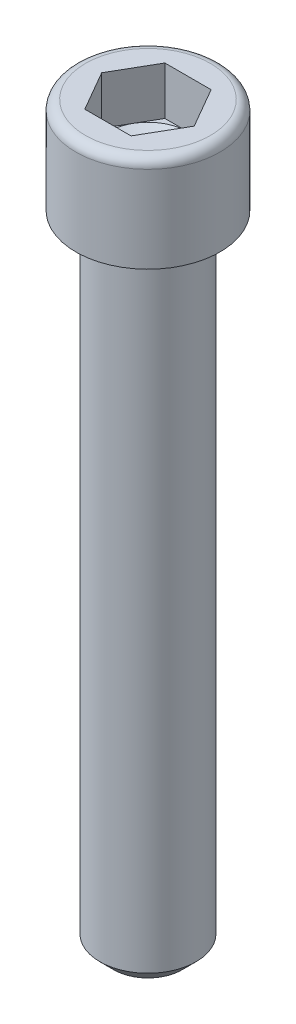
ISO-10303-21;
HEADER;
FILE_DESCRIPTION(('STEP AP214'),'2;1');
FILE_NAME('part.step','',(''),(''),'','','');
FILE_SCHEMA(('AUTOMOTIVE_DESIGN { 1 0 10303 214 1 1 1 1 }'));
ENDSEC;
DATA;
#1=APPLICATION_CONTEXT('core data for automotive mechanical design processes');
#2=APPLICATION_PROTOCOL_DEFINITION('international standard','automotive_design',2000,#1);
#3=PRODUCT_CONTEXT('',#1,'mechanical');
#4=PRODUCT('Part','Part','',(#3));
#5=PRODUCT_RELATED_PRODUCT_CATEGORY('part','',(#4));
#6=PRODUCT_DEFINITION_FORMATION('','',#4);
#7=PRODUCT_DEFINITION_CONTEXT('part definition',#1,'design');
#8=PRODUCT_DEFINITION('design','',#6,#7);
#9=PRODUCT_DEFINITION_SHAPE('','',#8);
#10=(LENGTH_UNIT() NAMED_UNIT(*) SI_UNIT(.MILLI.,.METRE.));
#11=(NAMED_UNIT(*) PLANE_ANGLE_UNIT() SI_UNIT($,.RADIAN.));
#12=(NAMED_UNIT(*) SI_UNIT($,.STERADIAN.) SOLID_ANGLE_UNIT());
#13=UNCERTAINTY_MEASURE_WITH_UNIT(LENGTH_MEASURE(1.E-05),#10,'distance_accuracy_value','');
#14=(GEOMETRIC_REPRESENTATION_CONTEXT(3) GLOBAL_UNCERTAINTY_ASSIGNED_CONTEXT((#13)) GLOBAL_UNIT_ASSIGNED_CONTEXT((#10,
#11,#12)) REPRESENTATION_CONTEXT('',''));
#15=CARTESIAN_POINT('',(0.,0.,0.));
#16=DIRECTION('',(0.,0.,1.));
#17=DIRECTION('',(1.,0.,0.));
#18=AXIS2_PLACEMENT_3D('',#15,#16,#17);
#19=CARTESIAN_POINT('',(4.99999999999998,11.9999999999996,1.52655665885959E-13));
#20=DIRECTION('',(0.,-1.,0.));
#21=DIRECTION('',(0.999999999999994,0.,0.));
#22=AXIS2_PLACEMENT_3D('',#19,#20,#21);
#23=PLANE('',#22);
#24=CARTESIAN_POINT('',(0.,12.,0.));
#25=DIRECTION('',(0.,1.,0.));
#26=DIRECTION('',(-0.999999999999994,0.,0.));
#27=AXIS2_PLACEMENT_3D('',#24,#25,#26);
#28=CIRCLE('',#27,7.8);
#29=CARTESIAN_POINT('',(-7.79999999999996,12.,0.));
#30=VERTEX_POINT('',#29);
#31=EDGE_CURVE('E140',#30,#30,#28,.T.);
#32=ORIENTED_EDGE('',*,*,#31,.T.);
#33=EDGE_LOOP('',(#32));
#34=FACE_BOUND('',#33,.T.);
#35=DIRECTION('',(0.499999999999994,0.,0.866025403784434));
#36=VECTOR('',#35,1.);
#37=CARTESIAN_POINT('',(2.88675134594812,11.9999999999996,-4.99999999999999));
#38=LINE('',#37,#36);
#39=CARTESIAN_POINT('',(2.88675134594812,11.9999999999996,-4.99999999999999));
#40=VERTEX_POINT('',#39);
#41=CARTESIAN_POINT('',(5.77350269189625,11.9999999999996,0.));
#42=VERTEX_POINT('',#41);
#43=EDGE_CURVE('E372',#40,#42,#38,.T.);
#44=ORIENTED_EDGE('',*,*,#43,.T.);
#45=DIRECTION('',(-0.499999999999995,0.,0.866025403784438));
#46=VECTOR('',#45,1.);
#47=CARTESIAN_POINT('',(2.88675134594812,12.,5.00000000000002));
#48=LINE('',#47,#46);
#49=CARTESIAN_POINT('',(2.88675134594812,12.,5.00000000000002));
#50=VERTEX_POINT('',#49);
#51=EDGE_CURVE('E375',#42,#50,#48,.T.);
#52=ORIENTED_EDGE('',*,*,#51,.T.);
#53=DIRECTION('',(-0.999999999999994,0.,0.));
#54=VECTOR('',#53,1.);
#55=CARTESIAN_POINT('',(2.88675134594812,12.,5.00000000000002));
#56=LINE('',#55,#54);
#57=CARTESIAN_POINT('',(-2.88675134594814,11.9999999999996,5.00000000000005));
#58=VERTEX_POINT('',#57);
#59=EDGE_CURVE('E378',#50,#58,#56,.T.);
#60=ORIENTED_EDGE('',*,*,#59,.T.);
#61=DIRECTION('',(-0.499999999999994,0.,-0.866025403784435));
#62=VECTOR('',#61,1.);
#63=CARTESIAN_POINT('',(-2.88675134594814,11.9999999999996,5.00000000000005));
#64=LINE('',#63,#62);
#65=CARTESIAN_POINT('',(-5.77350269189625,11.9999999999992,0.));
#66=VERTEX_POINT('',#65);
#67=EDGE_CURVE('E117',#58,#66,#64,.T.);
#68=ORIENTED_EDGE('',*,*,#67,.T.);
#69=DIRECTION('',(0.499999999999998,0.,-0.86602540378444));
#70=VECTOR('',#69,1.);
#71=CARTESIAN_POINT('',(-2.88675134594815,12.,-4.99999999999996));
#72=LINE('',#71,#70);
#73=CARTESIAN_POINT('',(-2.88675134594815,12.,-4.99999999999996));
#74=VERTEX_POINT('',#73);
#75=EDGE_CURVE('E369',#66,#74,#72,.T.);
#76=ORIENTED_EDGE('',*,*,#75,.T.);
#77=DIRECTION('',(0.999999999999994,0.,0.));
#78=VECTOR('',#77,1.);
#79=CARTESIAN_POINT('',(2.88675134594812,11.9999999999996,-4.99999999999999));
#80=LINE('',#79,#78);
#81=EDGE_CURVE('E128',#74,#40,#80,.T.);
#82=ORIENTED_EDGE('',*,*,#81,.T.);
#83=EDGE_LOOP('',(#44,#52,#60,#68,#76,#82));
#84=FACE_BOUND('',#83,.T.);
#85=ADVANCED_FACE('F34',(#34,#84),#23,.F.);
#86=CARTESIAN_POINT('',(0.,-80.,0.));
#87=DIRECTION('',(0.,1.,0.));
#88=DIRECTION('',(0.,0.,0.999999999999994));
#89=AXIS2_PLACEMENT_3D('',#86,#87,#88);
#90=CYLINDRICAL_SURFACE('',#89,6.);
#91=CARTESIAN_POINT('',(0.,-78.25,0.));
#92=DIRECTION('',(0.,1.,0.));
#93=DIRECTION('',(0.,0.,0.999999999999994));
#94=AXIS2_PLACEMENT_3D('',#91,#92,#93);
#95=CIRCLE('',#94,6.);
#96=CARTESIAN_POINT('',(0.,-78.25,5.99999999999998));
#97=VERTEX_POINT('',#96);
#98=EDGE_CURVE('E42',#97,#97,#95,.T.);
#99=ORIENTED_EDGE('',*,*,#98,.T.);
#100=EDGE_LOOP('',(#99));
#101=FACE_BOUND('',#100,.T.);
#102=CARTESIAN_POINT('',(0.,0.,0.));
#103=DIRECTION('',(0.,1.,0.));
#104=DIRECTION('',(0.,0.,0.999999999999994));
#105=AXIS2_PLACEMENT_3D('',#102,#103,#104);
#106=CIRCLE('',#105,6.);
#107=CARTESIAN_POINT('',(0.,0.,5.99999999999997));
#108=VERTEX_POINT('',#107);
#109=EDGE_CURVE('E150',#108,#108,#106,.T.);
#110=ORIENTED_EDGE('',*,*,#109,.F.);
#111=EDGE_LOOP('',(#110));
#112=FACE_BOUND('',#111,.T.);
#113=ADVANCED_FACE('F155',(#101,#112),#90,.T.);
#114=CARTESIAN_POINT('',(0.,-80.,0.));
#115=DIRECTION('',(0.,1.,0.));
#116=DIRECTION('',(0.,0.,0.999999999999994));
#117=AXIS2_PLACEMENT_3D('',#114,#115,#116);
#118=PLANE('',#117);
#119=CARTESIAN_POINT('',(0.,-80.,0.));
#120=DIRECTION('',(0.,1.,0.));
#121=DIRECTION('',(0.,0.,0.999999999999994));
#122=AXIS2_PLACEMENT_3D('',#119,#120,#121);
#123=CIRCLE('',#122,4.25);
#124=CARTESIAN_POINT('',(0.,-80.,4.24999999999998));
#125=VERTEX_POINT('',#124);
#126=EDGE_CURVE('E11',#125,#125,#123,.F.);
#127=ORIENTED_EDGE('',*,*,#126,.T.);
#128=EDGE_LOOP('',(#127));
#129=FACE_BOUND('',#128,.T.);
#130=ADVANCED_FACE('F160',(#129),#118,.F.);
#131=CARTESIAN_POINT('',(0.,-78.25,0.));
#132=DIRECTION('',(0.,1.,0.));
#133=DIRECTION('',(0.,0.,0.999999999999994));
#134=AXIS2_PLACEMENT_3D('',#131,#132,#133);
#135=CONICAL_SURFACE('',#134,6.,0.785398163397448);
#136=CARTESIAN_POINT('',(0.,-80.,4.24999999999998));
#137=CARTESIAN_POINT('',(0.,-79.9817708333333,4.26822916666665));
#138=CARTESIAN_POINT('',(0.,-79.9635416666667,4.28645833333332));
#139=CARTESIAN_POINT('',(0.,-79.9270833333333,4.32291666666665));
#140=CARTESIAN_POINT('',(0.,-79.9088541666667,4.34114583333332));
#141=CARTESIAN_POINT('',(0.,-79.8723958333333,4.37760416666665));
#142=CARTESIAN_POINT('',(0.,-79.8541666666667,4.39583333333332));
#143=CARTESIAN_POINT('',(0.,-79.8177083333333,4.43229166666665));
#144=CARTESIAN_POINT('',(0.,-79.7994791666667,4.45052083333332));
#145=CARTESIAN_POINT('',(0.,-79.7630208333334,4.48697916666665));
#146=CARTESIAN_POINT('',(0.,-79.7447916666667,4.50520833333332));
#147=CARTESIAN_POINT('',(0.,-79.7083333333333,4.54166666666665));
#148=CARTESIAN_POINT('',(0.,-79.6901041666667,4.55989583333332));
#149=CARTESIAN_POINT('',(0.,-79.6536458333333,4.59635416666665));
#150=CARTESIAN_POINT('',(0.,-79.6354166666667,4.61458333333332));
#151=CARTESIAN_POINT('',(0.,-79.5989583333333,4.65104166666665));
#152=CARTESIAN_POINT('',(0.,-79.5807291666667,4.66927083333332));
#153=CARTESIAN_POINT('',(0.,-79.5442708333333,4.70572916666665));
#154=CARTESIAN_POINT('',(0.,-79.5260416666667,4.72395833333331));
#155=CARTESIAN_POINT('',(0.,-79.4895833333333,4.76041666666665));
#156=CARTESIAN_POINT('',(0.,-79.4713541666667,4.77864583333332));
#157=CARTESIAN_POINT('',(0.,-79.4348958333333,4.81510416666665));
#158=CARTESIAN_POINT('',(0.,-79.4166666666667,4.83333333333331));
#159=CARTESIAN_POINT('',(0.,-79.3802083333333,4.86979166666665));
#160=CARTESIAN_POINT('',(0.,-79.3619791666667,4.88802083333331));
#161=CARTESIAN_POINT('',(0.,-79.3255208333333,4.92447916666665));
#162=CARTESIAN_POINT('',(0.,-79.3072916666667,4.94270833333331));
#163=CARTESIAN_POINT('',(0.,-79.2708333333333,4.97916666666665));
#164=CARTESIAN_POINT('',(0.,-79.2526041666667,4.99739583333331));
#165=CARTESIAN_POINT('',(0.,-79.2161458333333,5.03385416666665));
#166=CARTESIAN_POINT('',(0.,-79.1979166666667,5.05208333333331));
#167=CARTESIAN_POINT('',(0.,-79.1614583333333,5.08854166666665));
#168=CARTESIAN_POINT('',(0.,-79.1432291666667,5.10677083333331));
#169=CARTESIAN_POINT('',(0.,-79.1067708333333,5.14322916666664));
#170=CARTESIAN_POINT('',(0.,-79.0885416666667,5.16145833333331));
#171=CARTESIAN_POINT('',(0.,-79.0520833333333,5.19791666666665));
#172=CARTESIAN_POINT('',(0.,-79.0338541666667,5.21614583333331));
#173=CARTESIAN_POINT('',(0.,-78.9973958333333,5.25260416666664));
#174=CARTESIAN_POINT('',(0.,-78.9791666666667,5.27083333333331));
#175=CARTESIAN_POINT('',(0.,-78.9427083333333,5.30729166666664));
#176=CARTESIAN_POINT('',(0.,-78.9244791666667,5.32552083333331));
#177=CARTESIAN_POINT('',(0.,-78.8880208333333,5.36197916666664));
#178=CARTESIAN_POINT('',(0.,-78.8697916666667,5.38020833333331));
#179=CARTESIAN_POINT('',(0.,-78.8333333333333,5.41666666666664));
#180=CARTESIAN_POINT('',(0.,-78.8151041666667,5.43489583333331));
#181=CARTESIAN_POINT('',(0.,-78.7786458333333,5.47135416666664));
#182=CARTESIAN_POINT('',(0.,-78.7604166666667,5.48958333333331));
#183=CARTESIAN_POINT('',(0.,-78.7239583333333,5.52604166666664));
#184=CARTESIAN_POINT('',(0.,-78.7057291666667,5.54427083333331));
#185=CARTESIAN_POINT('',(0.,-78.6692708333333,5.58072916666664));
#186=CARTESIAN_POINT('',(0.,-78.6510416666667,5.59895833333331));
#187=CARTESIAN_POINT('',(0.,-78.6145833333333,5.63541666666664));
#188=CARTESIAN_POINT('',(0.,-78.5963541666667,5.65364583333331));
#189=CARTESIAN_POINT('',(0.,-78.5598958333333,5.69010416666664));
#190=CARTESIAN_POINT('',(0.,-78.5416666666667,5.70833333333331));
#191=CARTESIAN_POINT('',(0.,-78.5052083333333,5.74479166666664));
#192=CARTESIAN_POINT('',(0.,-78.4869791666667,5.76302083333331));
#193=CARTESIAN_POINT('',(0.,-78.4505208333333,5.79947916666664));
#194=CARTESIAN_POINT('',(0.,-78.4322916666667,5.81770833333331));
#195=CARTESIAN_POINT('',(0.,-78.3958333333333,5.85416666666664));
#196=CARTESIAN_POINT('',(0.,-78.3776041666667,5.87239583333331));
#197=CARTESIAN_POINT('',(0.,-78.3411458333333,5.90885416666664));
#198=CARTESIAN_POINT('',(0.,-78.3229166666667,5.92708333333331));
#199=CARTESIAN_POINT('',(0.,-78.2864583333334,5.96354166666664));
#200=CARTESIAN_POINT('',(0.,-78.2682291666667,5.98177083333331));
#201=CARTESIAN_POINT('',(0.,-78.25,5.99999999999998));
#202=B_SPLINE_CURVE_WITH_KNOTS('',3,(#136,#137,#138,#139,#140,#141,#142,#143,#144,#145,#146,
#147,#148,#149,#150,#151,#152,#153,#154,#155,#156,#157,#158,#159,#160,#161,#162,#163,#164,#165,
#166,#167,#168,#169,#170,#171,#172,#173,#174,#175,#176,#177,#178,#179,#180,#181,#182,#183,#184,
#185,#186,#187,#188,#189,#190,#191,#192,#193,#194,#195,#196,#197,#198,#199,#200,#201),
.UNSPECIFIED.,.F.,.F.,(4,2,2,2,2,2,2,2,2,2,2,2,2,2,2,2,2,2,2,2,2,2,2,2,2,2,2,2,2,2,2,2,4),(0.,
0.0773398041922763,0.154679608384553,0.23201941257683,0.309359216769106,0.386699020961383,
0.464038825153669,0.541378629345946,0.618718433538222,0.696058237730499,0.773398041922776,
0.850737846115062,0.928077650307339,1.00541745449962,1.08275725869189,1.16009706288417,
1.23743686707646,1.31477667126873,1.39211647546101,1.46945627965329,1.54679608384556,
1.62413588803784,1.70147569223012,1.7788154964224,1.85615530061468,1.93349510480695,
2.01083490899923,2.08817471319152,2.16551451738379,2.24285432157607,2.32019412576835,
2.39753392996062,2.4748737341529),.UNSPECIFIED.);
#203=EDGE_CURVE('BSEAM36',#125,#97,#202,.T.);
#204=ORIENTED_EDGE('',*,*,#126,.F.);
#205=ORIENTED_EDGE('',*,*,#98,.F.);
#206=ORIENTED_EDGE('',*,*,#203,.T.);
#207=ORIENTED_EDGE('',*,*,#203,.F.);
#208=EDGE_LOOP('',(#204,#206,#205,#207));
#209=FACE_BOUND('',#208,.T.);
#210=ADVANCED_FACE('F36',(#209),#135,.T.);
#211=CARTESIAN_POINT('',(0.,0.,0.));
#212=DIRECTION('',(0.,1.,0.));
#213=DIRECTION('',(-0.999999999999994,0.,0.));
#214=AXIS2_PLACEMENT_3D('',#211,#212,#213);
#215=PLANE('',#214);
#216=ORIENTED_EDGE('',*,*,#109,.T.);
#217=EDGE_LOOP('',(#216));
#218=FACE_BOUND('',#217,.T.);
#219=CARTESIAN_POINT('',(0.,0.,0.));
#220=DIRECTION('',(0.,1.,0.));
#221=DIRECTION('',(-0.999999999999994,0.,0.));
#222=AXIS2_PLACEMENT_3D('',#219,#220,#221);
#223=CIRCLE('',#222,9.);
#224=CARTESIAN_POINT('',(-8.99999999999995,0.,0.));
#225=VERTEX_POINT('',#224);
#226=EDGE_CURVE('E147',#225,#225,#223,.T.);
#227=ORIENTED_EDGE('',*,*,#226,.F.);
#228=EDGE_LOOP('',(#227));
#229=FACE_BOUND('',#228,.T.);
#230=ADVANCED_FACE('F159',(#218,#229),#215,.F.);
#231=CARTESIAN_POINT('',(0.,12.,0.));
#232=DIRECTION('',(0.,1.,0.));
#233=DIRECTION('',(-0.999999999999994,0.,0.));
#234=AXIS2_PLACEMENT_3D('',#231,#232,#233);
#235=CYLINDRICAL_SURFACE('',#234,9.);
#236=CARTESIAN_POINT('',(0.,10.8,0.));
#237=DIRECTION('',(0.,1.,0.));
#238=DIRECTION('',(-0.999999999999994,0.,0.));
#239=AXIS2_PLACEMENT_3D('',#236,#237,#238);
#240=CIRCLE('',#239,9.);
#241=CARTESIAN_POINT('',(-8.99999999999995,10.8,0.));
#242=VERTEX_POINT('',#241);
#243=EDGE_CURVE('E144',#242,#242,#240,.T.);
#244=ORIENTED_EDGE('',*,*,#243,.F.);
#245=EDGE_LOOP('',(#244));
#246=FACE_BOUND('',#245,.T.);
#247=ORIENTED_EDGE('',*,*,#226,.T.);
#248=EDGE_LOOP('',(#247));
#249=FACE_BOUND('',#248,.T.);
#250=ADVANCED_FACE('F166',(#246,#249),#235,.T.);
#251=CARTESIAN_POINT('',(0.,10.8,0.));
#252=DIRECTION('',(0.,1.,0.));
#253=DIRECTION('',(-0.999999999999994,0.,0.));
#254=AXIS2_PLACEMENT_3D('',#251,#252,#253);
#255=TOROIDAL_SURFACE('',#254,7.8,1.2);
#256=ORIENTED_EDGE('',*,*,#31,.F.);
#257=EDGE_LOOP('',(#256));
#258=FACE_BOUND('',#257,.T.);
#259=ORIENTED_EDGE('',*,*,#243,.T.);
#260=EDGE_LOOP('',(#259));
#261=FACE_BOUND('',#260,.T.);
#262=ADVANCED_FACE('F183',(#258,#261),#255,.T.);
#263=CARTESIAN_POINT('',(-2.88675134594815,6.00000000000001,-4.99999999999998));
#264=DIRECTION('',(0.866025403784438,0.,0.499999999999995));
#265=DIRECTION('',(0.499999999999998,0.,-0.86602540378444));
#266=AXIS2_PLACEMENT_3D('',#263,#264,#265);
#267=PLANE('',#266);
#268=ORIENTED_EDGE('',*,*,#75,.F.);
#269=DIRECTION('',(0.,1.,0.));
#270=VECTOR('',#269,1.);
#271=CARTESIAN_POINT('',(-5.77350269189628,5.99999999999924,0.));
#272=LINE('',#271,#270);
#273=CARTESIAN_POINT('',(-5.77350269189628,5.99999999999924,0.));
#274=VERTEX_POINT('',#273);
#275=EDGE_CURVE('E364',#274,#66,#272,.T.);
#276=ORIENTED_EDGE('',*,*,#275,.F.);
#277=DIRECTION('',(0.499999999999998,0.,-0.86602540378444));
#278=VECTOR('',#277,1.);
#279=CARTESIAN_POINT('',(-2.88675134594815,6.00000000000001,-4.99999999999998));
#280=LINE('',#279,#278);
#281=CARTESIAN_POINT('',(-4.33012701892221,5.99999999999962,-2.49999999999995));
#282=VERTEX_POINT('',#281);
#283=EDGE_CURVE('E113',#274,#282,#280,.T.);
#284=ORIENTED_EDGE('',*,*,#283,.T.);
#285=CARTESIAN_POINT('',(-2.88675134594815,6.00000000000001,-4.99999999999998));
#286=VERTEX_POINT('',#285);
#287=EDGE_CURVE('E107',#282,#286,#280,.T.);
#288=ORIENTED_EDGE('',*,*,#287,.T.);
#289=DIRECTION('',(0.,1.,0.));
#290=VECTOR('',#289,1.);
#291=CARTESIAN_POINT('',(-2.88675134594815,6.00000000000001,-4.99999999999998));
#292=LINE('',#291,#290);
#293=EDGE_CURVE('E109',#286,#74,#292,.T.);
#294=ORIENTED_EDGE('',*,*,#293,.T.);
#295=EDGE_LOOP('',(#268,#276,#284,#288,#294));
#296=FACE_BOUND('',#295,.T.);
#297=ADVANCED_FACE('F108',(#296),#267,.T.);
#298=CARTESIAN_POINT('',(2.88675134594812,5.99999999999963,-5.));
#299=DIRECTION('',(0.,0.,0.999999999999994));
#300=DIRECTION('',(0.999999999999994,0.,0.));
#301=AXIS2_PLACEMENT_3D('',#298,#299,#300);
#302=PLANE('',#301);
#303=ORIENTED_EDGE('',*,*,#81,.F.);
#304=ORIENTED_EDGE('',*,*,#293,.F.);
#305=DIRECTION('',(0.999999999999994,0.,0.));
#306=VECTOR('',#305,1.);
#307=CARTESIAN_POINT('',(2.88675134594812,5.99999999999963,-5.));
#308=LINE('',#307,#306);
#309=CARTESIAN_POINT('',(0.,5.99999999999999,-4.99999999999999));
#310=VERTEX_POINT('',#309);
#311=EDGE_CURVE('E49',#286,#310,#308,.T.);
#312=ORIENTED_EDGE('',*,*,#311,.T.);
#313=CARTESIAN_POINT('',(2.88675134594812,5.99999999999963,-5.));
#314=VERTEX_POINT('',#313);
#315=EDGE_CURVE('E123',#310,#314,#308,.T.);
#316=ORIENTED_EDGE('',*,*,#315,.T.);
#317=DIRECTION('',(0.,1.,0.));
#318=VECTOR('',#317,1.);
#319=CARTESIAN_POINT('',(2.88675134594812,5.99999999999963,-5.));
#320=LINE('',#319,#318);
#321=EDGE_CURVE('E130',#314,#40,#320,.T.);
#322=ORIENTED_EDGE('',*,*,#321,.T.);
#323=EDGE_LOOP('',(#303,#304,#312,#316,#322));
#324=FACE_BOUND('',#323,.T.);
#325=ADVANCED_FACE('F125',(#324),#302,.T.);
#326=CARTESIAN_POINT('',(2.88675134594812,5.99999999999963,-5.));
#327=DIRECTION('',(-0.866025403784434,0.,0.499999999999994));
#328=DIRECTION('',(0.499999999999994,0.,0.866025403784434));
#329=AXIS2_PLACEMENT_3D('',#326,#327,#328);
#330=PLANE('',#329);
#331=ORIENTED_EDGE('',*,*,#43,.F.);
#332=ORIENTED_EDGE('',*,*,#321,.F.);
#333=DIRECTION('',(0.499999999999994,0.,0.866025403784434));
#334=VECTOR('',#333,1.);
#335=CARTESIAN_POINT('',(2.88675134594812,5.99999999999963,-5.));
#336=LINE('',#335,#334);
#337=CARTESIAN_POINT('',(4.33012701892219,5.99999999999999,-2.49999999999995));
#338=VERTEX_POINT('',#337);
#339=EDGE_CURVE('E397',#314,#338,#336,.T.);
#340=ORIENTED_EDGE('',*,*,#339,.T.);
#341=CARTESIAN_POINT('',(5.77350269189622,5.99999999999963,0.));
#342=VERTEX_POINT('',#341);
#343=EDGE_CURVE('E122',#338,#342,#336,.T.);
#344=ORIENTED_EDGE('',*,*,#343,.T.);
#345=DIRECTION('',(0.,1.,0.));
#346=VECTOR('',#345,1.);
#347=CARTESIAN_POINT('',(5.77350269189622,5.99999999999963,0.));
#348=LINE('',#347,#346);
#349=EDGE_CURVE('E135',#342,#42,#348,.T.);
#350=ORIENTED_EDGE('',*,*,#349,.T.);
#351=EDGE_LOOP('',(#331,#332,#340,#344,#350));
#352=FACE_BOUND('',#351,.T.);
#353=ADVANCED_FACE('F213',(#352),#330,.T.);
#354=CARTESIAN_POINT('',(2.88675134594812,6.00000000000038,5.));
#355=DIRECTION('',(-0.86602540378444,0.,-0.499999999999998));
#356=DIRECTION('',(-0.499999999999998,0.,0.86602540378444));
#357=AXIS2_PLACEMENT_3D('',#354,#355,#356);
#358=PLANE('',#357);
#359=ORIENTED_EDGE('',*,*,#51,.F.);
#360=ORIENTED_EDGE('',*,*,#349,.F.);
#361=DIRECTION('',(-0.499999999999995,0.,0.866025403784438));
#362=VECTOR('',#361,1.);
#363=CARTESIAN_POINT('',(2.88675134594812,6.00000000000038,5.));
#364=LINE('',#363,#362);
#365=CARTESIAN_POINT('',(4.33012701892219,6.00000000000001,2.49999999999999));
#366=VERTEX_POINT('',#365);
#367=EDGE_CURVE('E395',#342,#366,#364,.T.);
#368=ORIENTED_EDGE('',*,*,#367,.T.);
#369=CARTESIAN_POINT('',(2.88675134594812,6.00000000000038,5.));
#370=VERTEX_POINT('',#369);
#371=EDGE_CURVE('E396',#366,#370,#364,.T.);
#372=ORIENTED_EDGE('',*,*,#371,.T.);
#373=DIRECTION('',(0.,1.,0.));
#374=VECTOR('',#373,1.);
#375=CARTESIAN_POINT('',(2.88675134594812,6.00000000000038,5.));
#376=LINE('',#375,#374);
#377=EDGE_CURVE('E384',#370,#50,#376,.T.);
#378=ORIENTED_EDGE('',*,*,#377,.T.);
#379=EDGE_LOOP('',(#359,#360,#368,#372,#378));
#380=FACE_BOUND('',#379,.T.);
#381=ADVANCED_FACE('F220',(#380),#358,.T.);
#382=CARTESIAN_POINT('',(2.88675134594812,6.00000000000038,5.));
#383=DIRECTION('',(0.,0.,-0.999999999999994));
#384=DIRECTION('',(-0.999999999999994,0.,0.));
#385=AXIS2_PLACEMENT_3D('',#382,#383,#384);
#386=PLANE('',#385);
#387=ORIENTED_EDGE('',*,*,#59,.F.);
#388=ORIENTED_EDGE('',*,*,#377,.F.);
#389=DIRECTION('',(-0.999999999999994,0.,0.));
#390=VECTOR('',#389,1.);
#391=CARTESIAN_POINT('',(2.88675134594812,6.00000000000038,5.));
#392=LINE('',#391,#390);
#393=CARTESIAN_POINT('',(0.,6.00000000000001,5.));
#394=VERTEX_POINT('',#393);
#395=EDGE_CURVE('E359',#370,#394,#392,.T.);
#396=ORIENTED_EDGE('',*,*,#395,.T.);
#397=CARTESIAN_POINT('',(-2.88675134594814,5.99999999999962,5.00000000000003));
#398=VERTEX_POINT('',#397);
#399=EDGE_CURVE('E355',#394,#398,#392,.T.);
#400=ORIENTED_EDGE('',*,*,#399,.T.);
#401=DIRECTION('',(0.,1.,0.));
#402=VECTOR('',#401,1.);
#403=CARTESIAN_POINT('',(-2.88675134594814,5.99999999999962,5.00000000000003));
#404=LINE('',#403,#402);
#405=EDGE_CURVE('E363',#398,#58,#404,.T.);
#406=ORIENTED_EDGE('',*,*,#405,.T.);
#407=EDGE_LOOP('',(#387,#388,#396,#400,#406));
#408=FACE_BOUND('',#407,.T.);
#409=ADVANCED_FACE('F228',(#408),#386,.T.);
#410=CARTESIAN_POINT('',(-2.88675134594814,5.99999999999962,5.00000000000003));
#411=DIRECTION('',(0.866025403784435,0.,-0.499999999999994));
#412=DIRECTION('',(-0.499999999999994,0.,-0.866025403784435));
#413=AXIS2_PLACEMENT_3D('',#410,#411,#412);
#414=PLANE('',#413);
#415=ORIENTED_EDGE('',*,*,#67,.F.);
#416=ORIENTED_EDGE('',*,*,#405,.F.);
#417=DIRECTION('',(-0.499999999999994,0.,-0.866025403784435));
#418=VECTOR('',#417,1.);
#419=CARTESIAN_POINT('',(-2.88675134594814,5.99999999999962,5.00000000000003));
#420=LINE('',#419,#418);
#421=CARTESIAN_POINT('',(-4.33012701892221,5.99999999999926,2.49999999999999));
#422=VERTEX_POINT('',#421);
#423=EDGE_CURVE('E354',#398,#422,#420,.T.);
#424=ORIENTED_EDGE('',*,*,#423,.T.);
#425=EDGE_CURVE('E357',#422,#274,#420,.T.);
#426=ORIENTED_EDGE('',*,*,#425,.T.);
#427=ORIENTED_EDGE('',*,*,#275,.T.);
#428=EDGE_LOOP('',(#415,#416,#424,#426,#427));
#429=FACE_BOUND('',#428,.T.);
#430=ADVANCED_FACE('F236',(#429),#414,.T.);
#431=CARTESIAN_POINT('',(-8.66025403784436,5.99999999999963,5.));
#432=DIRECTION('',(0.,-1.,0.));
#433=DIRECTION('',(0.,0.,-0.999999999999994));
#434=AXIS2_PLACEMENT_3D('',#431,#432,#433);
#435=PLANE('',#434);
#436=ORIENTED_EDGE('',*,*,#311,.F.);
#437=ORIENTED_EDGE('',*,*,#287,.F.);
#438=CARTESIAN_POINT('',(0.,6.00000000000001,0.));
#439=DIRECTION('',(0.,1.,0.));
#440=DIRECTION('',(-0.999999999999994,0.,0.));
#441=AXIS2_PLACEMENT_3D('',#438,#439,#440);
#442=CIRCLE('',#441,5.);
#443=EDGE_CURVE('E120',#310,#282,#442,.T.);
#444=ORIENTED_EDGE('',*,*,#443,.F.);
#445=EDGE_LOOP('',(#436,#437,#444));
#446=FACE_BOUND('',#445,.T.);
#447=ADVANCED_FACE('F119',(#446),#435,.F.);
#448=ORIENTED_EDGE('',*,*,#283,.F.);
#449=ORIENTED_EDGE('',*,*,#425,.F.);
#450=EDGE_CURVE('E129',#282,#422,#442,.T.);
#451=ORIENTED_EDGE('',*,*,#450,.F.);
#452=EDGE_LOOP('',(#448,#449,#451));
#453=FACE_BOUND('',#452,.T.);
#454=ADVANCED_FACE('F251',(#453),#435,.F.);
#455=ORIENTED_EDGE('',*,*,#423,.F.);
#456=ORIENTED_EDGE('',*,*,#399,.F.);
#457=EDGE_CURVE('E134',#422,#394,#442,.T.);
#458=ORIENTED_EDGE('',*,*,#457,.F.);
#459=EDGE_LOOP('',(#455,#456,#458));
#460=FACE_BOUND('',#459,.T.);
#461=ADVANCED_FACE('F259',(#460),#435,.F.);
#462=ORIENTED_EDGE('',*,*,#395,.F.);
#463=ORIENTED_EDGE('',*,*,#371,.F.);
#464=EDGE_CURVE('E141',#394,#366,#442,.T.);
#465=ORIENTED_EDGE('',*,*,#464,.F.);
#466=EDGE_LOOP('',(#462,#463,#465));
#467=FACE_BOUND('',#466,.T.);
#468=ADVANCED_FACE('F266',(#467),#435,.F.);
#469=ORIENTED_EDGE('',*,*,#367,.F.);
#470=ORIENTED_EDGE('',*,*,#343,.F.);
#471=EDGE_CURVE('E401',#366,#338,#442,.T.);
#472=ORIENTED_EDGE('',*,*,#471,.F.);
#473=EDGE_LOOP('',(#469,#470,#472));
#474=FACE_BOUND('',#473,.T.);
#475=ADVANCED_FACE('F273',(#474),#435,.F.);
#476=ORIENTED_EDGE('',*,*,#339,.F.);
#477=ORIENTED_EDGE('',*,*,#315,.F.);
#478=EDGE_CURVE('E400',#338,#310,#442,.T.);
#479=ORIENTED_EDGE('',*,*,#478,.F.);
#480=EDGE_LOOP('',(#476,#477,#479));
#481=FACE_BOUND('',#480,.T.);
#482=ADVANCED_FACE('F253',(#481),#435,.F.);
#483=CARTESIAN_POINT('',(0.,6.00000000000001,0.));
#484=DIRECTION('',(0.,1.,0.));
#485=DIRECTION('',(-0.999999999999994,0.,0.));
#486=AXIS2_PLACEMENT_3D('',#483,#484,#485);
#487=CONICAL_SURFACE('',#486,5.,1.04719755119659);
#488=CARTESIAN_POINT('',(0.,3.11324865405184,0.));
#489=VERTEX_POINT('',#488);
#490=VERTEX_LOOP('',#489);
#491=FACE_BOUND('',#490,.T.);
#492=ORIENTED_EDGE('',*,*,#457,.T.);
#493=ORIENTED_EDGE('',*,*,#464,.T.);
#494=ORIENTED_EDGE('',*,*,#471,.T.);
#495=ORIENTED_EDGE('',*,*,#478,.T.);
#496=ORIENTED_EDGE('',*,*,#443,.T.);
#497=ORIENTED_EDGE('',*,*,#450,.T.);
#498=EDGE_LOOP('',(#492,#493,#494,#495,#496,#497));
#499=FACE_BOUND('',#498,.T.);
#500=ADVANCED_FACE('F181',(#491,#499),#487,.F.);
#501=CLOSED_SHELL('',(#85,#113,#130,#210,#230,#250,#262,#297,#325,#353,#381,#409,#430,#447,#454,
#461,#468,#475,#482,#500));
#502=MANIFOLD_SOLID_BREP('B2',#501);
#503=ADVANCED_BREP_SHAPE_REPRESENTATION('',(#18,#502),#14);
#504=SHAPE_DEFINITION_REPRESENTATION(#9,#503);
ENDSEC;
END-ISO-10303-21;
